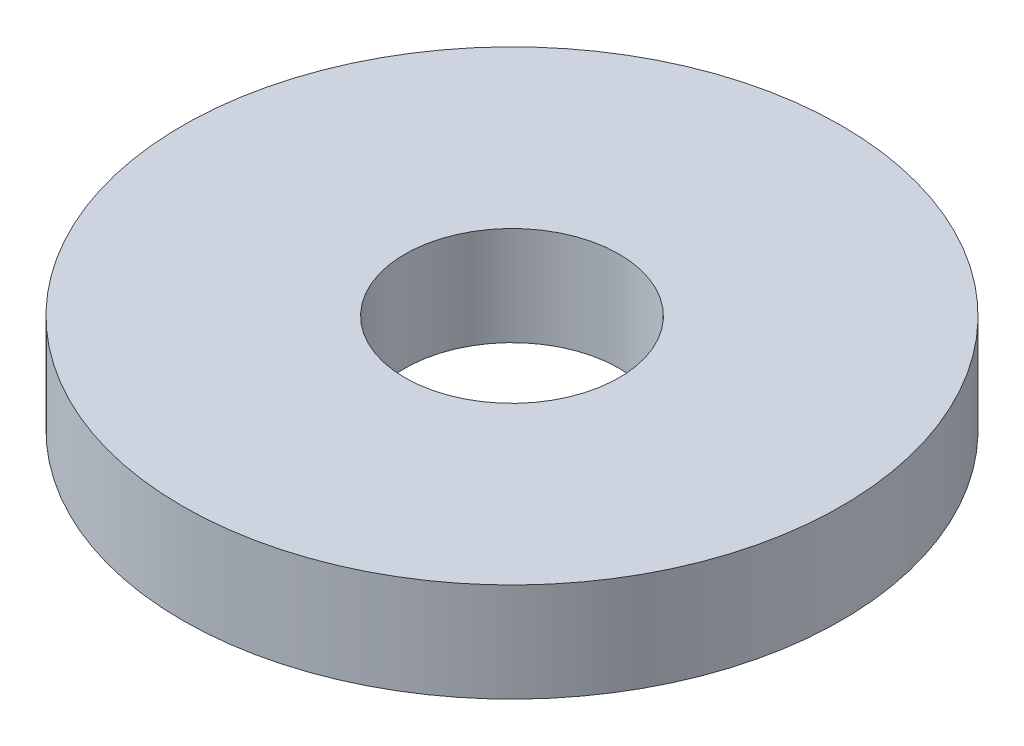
from build123d import *

# Parameters (mm, degrees)
ESQUISSE1_R      = 10
ESQUISSE1_R_2    = 3.25
EXTRUSION1_DEPTH = 3


with BuildPart() as part:
    # Esquisse1 → Extrusion1 (new body)
    with BuildSketch(Plane(origin=(0, 0, 0), x_dir=(1, 0, 0), z_dir=(0, 1, 0))):
        with Locations(Location((0, 0, 0), (0, 0, 270))):
            Circle(ESQUISSE1_R)
        with Locations(Location((0, 0, 0), (0, 0, 270))):
            Circle(ESQUISSE1_R_2, mode=Mode.SUBTRACT)
    extrude(amount=EXTRUSION1_DEPTH)


solid = part.part
